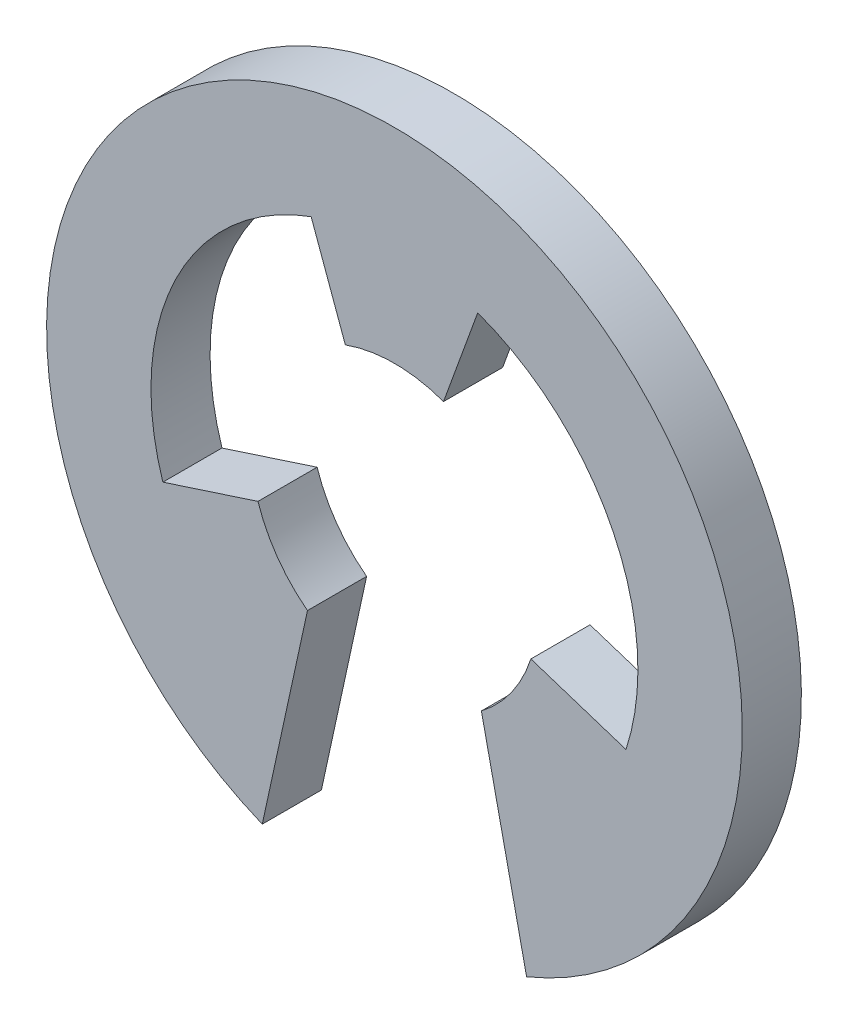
ISO-10303-21;
HEADER;
FILE_DESCRIPTION(('STEP AP214'),'2;1');
FILE_NAME('part.step','',(''),(''),'','','');
FILE_SCHEMA(('AUTOMOTIVE_DESIGN { 1 0 10303 214 1 1 1 1 }'));
ENDSEC;
DATA;
#1=APPLICATION_CONTEXT('core data for automotive mechanical design processes');
#2=APPLICATION_PROTOCOL_DEFINITION('international standard','automotive_design',2000,#1);
#3=PRODUCT_CONTEXT('',#1,'mechanical');
#4=PRODUCT('Part','Part','',(#3));
#5=PRODUCT_RELATED_PRODUCT_CATEGORY('part','',(#4));
#6=PRODUCT_DEFINITION_FORMATION('','',#4);
#7=PRODUCT_DEFINITION_CONTEXT('part definition',#1,'design');
#8=PRODUCT_DEFINITION('design','',#6,#7);
#9=PRODUCT_DEFINITION_SHAPE('','',#8);
#10=(LENGTH_UNIT() NAMED_UNIT(*) SI_UNIT(.MILLI.,.METRE.));
#11=(NAMED_UNIT(*) PLANE_ANGLE_UNIT() SI_UNIT($,.RADIAN.));
#12=(NAMED_UNIT(*) SI_UNIT($,.STERADIAN.) SOLID_ANGLE_UNIT());
#13=UNCERTAINTY_MEASURE_WITH_UNIT(LENGTH_MEASURE(1.E-05),#10,'distance_accuracy_value','');
#14=(GEOMETRIC_REPRESENTATION_CONTEXT(3) GLOBAL_UNCERTAINTY_ASSIGNED_CONTEXT((#13)) GLOBAL_UNIT_ASSIGNED_CONTEXT((#10,
#11,#12)) REPRESENTATION_CONTEXT('',''));
#15=CARTESIAN_POINT('',(0.,0.,0.));
#16=DIRECTION('',(0.,0.,1.));
#17=DIRECTION('',(1.,0.,0.));
#18=AXIS2_PLACEMENT_3D('',#15,#16,#17);
#19=CARTESIAN_POINT('',(0.,0.,0.68));
#20=DIRECTION('',(0.,0.,-1.));
#21=DIRECTION('',(-1.,0.,0.));
#22=AXIS2_PLACEMENT_3D('',#19,#20,#21);
#23=CYLINDRICAL_SURFACE('',#22,2.8);
#24=CARTESIAN_POINT('',(0.,0.,0.));
#25=DIRECTION('',(0.,0.,-1.));
#26=DIRECTION('',(1.,0.,0.));
#27=AXIS2_PLACEMENT_3D('',#24,#25,#26);
#28=CIRCLE('',#27,2.8);
#29=CARTESIAN_POINT('',(-2.66295824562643,-0.865247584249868,0.));
#30=VERTEX_POINT('',#29);
#31=CARTESIAN_POINT('',(-0.957656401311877,2.63113933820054,0.));
#32=VERTEX_POINT('',#31);
#33=EDGE_CURVE('E154',#30,#32,#28,.T.);
#34=ORIENTED_EDGE('',*,*,#33,.T.);
#35=DIRECTION('',(0.,0.,-1.));
#36=VECTOR('',#35,1.);
#37=CARTESIAN_POINT('',(-0.957656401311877,2.63113933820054,0.68));
#38=LINE('',#37,#36);
#39=CARTESIAN_POINT('',(-0.957656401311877,2.63113933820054,0.68));
#40=VERTEX_POINT('',#39);
#41=EDGE_CURVE('E11',#40,#32,#38,.T.);
#42=ORIENTED_EDGE('',*,*,#41,.F.);
#43=CARTESIAN_POINT('',(0.,0.,0.68));
#44=DIRECTION('',(0.,0.,-1.));
#45=DIRECTION('',(1.,0.,0.));
#46=AXIS2_PLACEMENT_3D('',#43,#44,#45);
#47=CIRCLE('',#46,2.8);
#48=CARTESIAN_POINT('',(-2.66295824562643,-0.865247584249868,0.68));
#49=VERTEX_POINT('',#48);
#50=EDGE_CURVE('E176',#49,#40,#47,.T.);
#51=ORIENTED_EDGE('',*,*,#50,.F.);
#52=DIRECTION('',(0.,0.,-1.));
#53=VECTOR('',#52,1.);
#54=CARTESIAN_POINT('',(-2.66295824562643,-0.865247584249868,0.68));
#55=LINE('',#54,#53);
#56=EDGE_CURVE('E150',#49,#30,#55,.T.);
#57=ORIENTED_EDGE('',*,*,#56,.T.);
#58=EDGE_LOOP('',(#34,#42,#51,#57));
#59=FACE_BOUND('',#58,.T.);
#60=ADVANCED_FACE('F34',(#59),#23,.F.);
#61=CARTESIAN_POINT('',(-0.564333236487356,1.55049282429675,0.68));
#62=DIRECTION('',(0.939692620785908,0.34202014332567,0.));
#63=DIRECTION('',(-0.34202014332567,0.939692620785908,0.));
#64=AXIS2_PLACEMENT_3D('',#61,#62,#63);
#65=PLANE('',#64);
#66=DIRECTION('',(0.34202014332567,-0.939692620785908,0.));
#67=VECTOR('',#66,1.);
#68=CARTESIAN_POINT('',(-0.564333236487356,1.55049282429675,0.));
#69=LINE('',#68,#67);
#70=CARTESIAN_POINT('',(-0.564333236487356,1.55049282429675,0.));
#71=VERTEX_POINT('',#70);
#72=EDGE_CURVE('E157',#32,#71,#69,.T.);
#73=ORIENTED_EDGE('',*,*,#72,.T.);
#74=DIRECTION('',(0.,0.,-1.));
#75=VECTOR('',#74,1.);
#76=CARTESIAN_POINT('',(-0.564333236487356,1.55049282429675,0.68));
#77=LINE('',#76,#75);
#78=CARTESIAN_POINT('',(-0.564333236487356,1.55049282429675,0.68));
#79=VERTEX_POINT('',#78);
#80=EDGE_CURVE('E42',#79,#71,#77,.T.);
#81=ORIENTED_EDGE('',*,*,#80,.F.);
#82=DIRECTION('',(0.34202014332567,-0.939692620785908,0.));
#83=VECTOR('',#82,1.);
#84=CARTESIAN_POINT('',(-0.564333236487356,1.55049282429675,0.68));
#85=LINE('',#84,#83);
#86=EDGE_CURVE('E105',#40,#79,#85,.T.);
#87=ORIENTED_EDGE('',*,*,#86,.F.);
#88=ORIENTED_EDGE('',*,*,#41,.T.);
#89=EDGE_LOOP('',(#73,#81,#87,#88));
#90=FACE_BOUND('',#89,.T.);
#91=ADVANCED_FACE('F254',(#90),#65,.F.);
#92=CARTESIAN_POINT('',(0.,0.,0.68));
#93=DIRECTION('',(0.,0.,-1.));
#94=DIRECTION('',(-1.,0.,0.));
#95=AXIS2_PLACEMENT_3D('',#92,#93,#94);
#96=CYLINDRICAL_SURFACE('',#95,1.65);
#97=CARTESIAN_POINT('',(0.,0.,0.));
#98=DIRECTION('',(0.,0.,-1.));
#99=DIRECTION('',(1.,0.,0.));
#100=AXIS2_PLACEMENT_3D('',#97,#98,#99);
#101=CIRCLE('',#100,1.65);
#102=CARTESIAN_POINT('',(0.564333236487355,1.55049282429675,0.));
#103=VERTEX_POINT('',#102);
#104=EDGE_CURVE('E159',#71,#103,#101,.T.);
#105=ORIENTED_EDGE('',*,*,#104,.T.);
#106=DIRECTION('',(0.,0.,-1.));
#107=VECTOR('',#106,1.);
#108=CARTESIAN_POINT('',(0.564333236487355,1.55049282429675,0.68));
#109=LINE('',#108,#107);
#110=CARTESIAN_POINT('',(0.564333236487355,1.55049282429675,0.68));
#111=VERTEX_POINT('',#110);
#112=EDGE_CURVE('E195',#111,#103,#109,.T.);
#113=ORIENTED_EDGE('',*,*,#112,.F.);
#114=CARTESIAN_POINT('',(0.,0.,0.68));
#115=DIRECTION('',(0.,0.,-1.));
#116=DIRECTION('',(1.,0.,0.));
#117=AXIS2_PLACEMENT_3D('',#114,#115,#116);
#118=CIRCLE('',#117,1.65);
#119=EDGE_CURVE('E203',#79,#111,#118,.T.);
#120=ORIENTED_EDGE('',*,*,#119,.F.);
#121=ORIENTED_EDGE('',*,*,#80,.T.);
#122=EDGE_LOOP('',(#105,#113,#120,#121));
#123=FACE_BOUND('',#122,.T.);
#124=ADVANCED_FACE('F201',(#123),#96,.F.);
#125=CARTESIAN_POINT('',(0.564333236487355,1.55049282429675,0.68));
#126=DIRECTION('',(-0.939692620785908,0.34202014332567,0.));
#127=DIRECTION('',(-0.34202014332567,-0.939692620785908,0.));
#128=AXIS2_PLACEMENT_3D('',#125,#126,#127);
#129=PLANE('',#128);
#130=DIRECTION('',(0.34202014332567,0.939692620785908,0.));
#131=VECTOR('',#130,1.);
#132=CARTESIAN_POINT('',(0.564333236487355,1.55049282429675,0.));
#133=LINE('',#132,#131);
#134=CARTESIAN_POINT('',(0.957656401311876,2.63113933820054,0.));
#135=VERTEX_POINT('',#134);
#136=EDGE_CURVE('E161',#103,#135,#133,.T.);
#137=ORIENTED_EDGE('',*,*,#136,.T.);
#138=DIRECTION('',(0.,0.,-1.));
#139=VECTOR('',#138,1.);
#140=CARTESIAN_POINT('',(0.957656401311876,2.63113933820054,0.68));
#141=LINE('',#140,#139);
#142=CARTESIAN_POINT('',(0.957656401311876,2.63113933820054,0.68));
#143=VERTEX_POINT('',#142);
#144=EDGE_CURVE('E192',#143,#135,#141,.T.);
#145=ORIENTED_EDGE('',*,*,#144,.F.);
#146=DIRECTION('',(0.34202014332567,0.939692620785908,0.));
#147=VECTOR('',#146,1.);
#148=CARTESIAN_POINT('',(0.564333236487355,1.55049282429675,0.68));
#149=LINE('',#148,#147);
#150=EDGE_CURVE('E221',#111,#143,#149,.T.);
#151=ORIENTED_EDGE('',*,*,#150,.F.);
#152=ORIENTED_EDGE('',*,*,#112,.T.);
#153=EDGE_LOOP('',(#137,#145,#151,#152));
#154=FACE_BOUND('',#153,.T.);
#155=ADVANCED_FACE('F212',(#154),#129,.F.);
#156=CARTESIAN_POINT('',(0.,0.,0.68));
#157=DIRECTION('',(0.,0.,-1.));
#158=DIRECTION('',(-1.,0.,0.));
#159=AXIS2_PLACEMENT_3D('',#156,#157,#158);
#160=CYLINDRICAL_SURFACE('',#159,2.8);
#161=CARTESIAN_POINT('',(0.,0.,0.));
#162=DIRECTION('',(0.,0.,-1.));
#163=DIRECTION('',(1.,0.,0.));
#164=AXIS2_PLACEMENT_3D('',#161,#162,#163);
#165=CIRCLE('',#164,2.8);
#166=CARTESIAN_POINT('',(2.66295824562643,-0.865247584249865,0.));
#167=VERTEX_POINT('',#166);
#168=EDGE_CURVE('E163',#135,#167,#165,.T.);
#169=ORIENTED_EDGE('',*,*,#168,.T.);
#170=DIRECTION('',(0.,0.,-1.));
#171=VECTOR('',#170,1.);
#172=CARTESIAN_POINT('',(2.66295824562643,-0.865247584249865,0.68));
#173=LINE('',#172,#171);
#174=CARTESIAN_POINT('',(2.66295824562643,-0.865247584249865,0.68));
#175=VERTEX_POINT('',#174);
#176=EDGE_CURVE('E189',#175,#167,#173,.T.);
#177=ORIENTED_EDGE('',*,*,#176,.F.);
#178=CARTESIAN_POINT('',(0.,0.,0.68));
#179=DIRECTION('',(0.,0.,-1.));
#180=DIRECTION('',(1.,0.,0.));
#181=AXIS2_PLACEMENT_3D('',#178,#179,#180);
#182=CIRCLE('',#181,2.8);
#183=EDGE_CURVE('E218',#143,#175,#182,.T.);
#184=ORIENTED_EDGE('',*,*,#183,.F.);
#185=ORIENTED_EDGE('',*,*,#144,.T.);
#186=EDGE_LOOP('',(#169,#177,#184,#185));
#187=FACE_BOUND('',#186,.T.);
#188=ADVANCED_FACE('F216',(#187),#160,.F.);
#189=CARTESIAN_POINT('',(1.569243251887,-0.50987804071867,0.68));
#190=DIRECTION('',(-0.309016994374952,-0.951056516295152,0.));
#191=DIRECTION('',(0.951056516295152,-0.309016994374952,0.));
#192=AXIS2_PLACEMENT_3D('',#189,#190,#191);
#193=PLANE('',#192);
#194=DIRECTION('',(-0.951056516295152,0.309016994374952,0.));
#195=VECTOR('',#194,1.);
#196=CARTESIAN_POINT('',(1.569243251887,-0.50987804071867,0.));
#197=LINE('',#196,#195);
#198=CARTESIAN_POINT('',(1.569243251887,-0.509878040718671,0.));
#199=VERTEX_POINT('',#198);
#200=EDGE_CURVE('E165',#167,#199,#197,.T.);
#201=ORIENTED_EDGE('',*,*,#200,.T.);
#202=DIRECTION('',(0.,0.,-1.));
#203=VECTOR('',#202,1.);
#204=CARTESIAN_POINT('',(1.569243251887,-0.509878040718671,0.68));
#205=LINE('',#204,#203);
#206=CARTESIAN_POINT('',(1.569243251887,-0.509878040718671,0.68));
#207=VERTEX_POINT('',#206);
#208=EDGE_CURVE('E186',#207,#199,#205,.T.);
#209=ORIENTED_EDGE('',*,*,#208,.F.);
#210=DIRECTION('',(-0.951056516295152,0.309016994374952,0.));
#211=VECTOR('',#210,1.);
#212=CARTESIAN_POINT('',(1.569243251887,-0.50987804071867,0.68));
#213=LINE('',#212,#211);
#214=EDGE_CURVE('E220',#175,#207,#213,.T.);
#215=ORIENTED_EDGE('',*,*,#214,.F.);
#216=ORIENTED_EDGE('',*,*,#176,.T.);
#217=EDGE_LOOP('',(#201,#209,#215,#216));
#218=FACE_BOUND('',#217,.T.);
#219=ADVANCED_FACE('F267',(#218),#193,.F.);
#220=CARTESIAN_POINT('',(0.,0.,0.68));
#221=DIRECTION('',(0.,0.,-1.));
#222=DIRECTION('',(-1.,0.,0.));
#223=AXIS2_PLACEMENT_3D('',#220,#221,#222);
#224=CYLINDRICAL_SURFACE('',#223,1.65);
#225=CARTESIAN_POINT('',(0.,0.,0.));
#226=DIRECTION('',(0.,0.,-1.));
#227=DIRECTION('',(1.,0.,0.));
#228=AXIS2_PLACEMENT_3D('',#225,#226,#227);
#229=CIRCLE('',#228,1.65);
#230=CARTESIAN_POINT('',(1.,-1.31244047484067,0.));
#231=VERTEX_POINT('',#230);
#232=EDGE_CURVE('E167',#199,#231,#229,.T.);
#233=ORIENTED_EDGE('',*,*,#232,.T.);
#234=DIRECTION('',(0.,0.,-1.));
#235=VECTOR('',#234,1.);
#236=CARTESIAN_POINT('',(1.,-1.31244047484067,0.68));
#237=LINE('',#236,#235);
#238=CARTESIAN_POINT('',(1.,-1.31244047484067,0.68));
#239=VERTEX_POINT('',#238);
#240=EDGE_CURVE('E183',#239,#231,#237,.T.);
#241=ORIENTED_EDGE('',*,*,#240,.F.);
#242=CARTESIAN_POINT('',(0.,0.,0.68));
#243=DIRECTION('',(0.,0.,-1.));
#244=DIRECTION('',(1.,0.,0.));
#245=AXIS2_PLACEMENT_3D('',#242,#243,#244);
#246=CIRCLE('',#245,1.65);
#247=EDGE_CURVE('E223',#207,#239,#246,.T.);
#248=ORIENTED_EDGE('',*,*,#247,.F.);
#249=ORIENTED_EDGE('',*,*,#208,.T.);
#250=EDGE_LOOP('',(#233,#241,#248,#249));
#251=FACE_BOUND('',#250,.T.);
#252=ADVANCED_FACE('F270',(#251),#224,.F.);
#253=CARTESIAN_POINT('',(1.,-1.31244047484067,0.68));
#254=DIRECTION('',(0.97710548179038,0.212755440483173,0.));
#255=DIRECTION('',(-0.212755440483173,0.97710548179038,0.));
#256=AXIS2_PLACEMENT_3D('',#253,#254,#255);
#257=PLANE('',#256);
#258=DIRECTION('',(0.212755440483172,-0.97710548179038,0.));
#259=VECTOR('',#258,1.);
#260=CARTESIAN_POINT('',(1.,-1.31244047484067,0.));
#261=LINE('',#260,#259);
#262=CARTESIAN_POINT('',(1.51986841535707,-3.7,0.));
#263=VERTEX_POINT('',#262);
#264=EDGE_CURVE('E169',#231,#263,#261,.T.);
#265=ORIENTED_EDGE('',*,*,#264,.T.);
#266=DIRECTION('',(0.,0.,-1.));
#267=VECTOR('',#266,1.);
#268=CARTESIAN_POINT('',(1.51986841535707,-3.7,0.68));
#269=LINE('',#268,#267);
#270=CARTESIAN_POINT('',(1.51986841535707,-3.7,0.68));
#271=VERTEX_POINT('',#270);
#272=EDGE_CURVE('E180',#271,#263,#269,.T.);
#273=ORIENTED_EDGE('',*,*,#272,.F.);
#274=DIRECTION('',(0.212755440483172,-0.97710548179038,0.));
#275=VECTOR('',#274,1.);
#276=CARTESIAN_POINT('',(1.,-1.31244047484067,0.68));
#277=LINE('',#276,#275);
#278=EDGE_CURVE('E229',#239,#271,#277,.T.);
#279=ORIENTED_EDGE('',*,*,#278,.F.);
#280=ORIENTED_EDGE('',*,*,#240,.T.);
#281=EDGE_LOOP('',(#265,#273,#279,#280));
#282=FACE_BOUND('',#281,.T.);
#283=ADVANCED_FACE('F235',(#282),#257,.F.);
#284=CARTESIAN_POINT('',(0.,0.,0.68));
#285=DIRECTION('',(0.,0.,-1.));
#286=DIRECTION('',(-1.,0.,0.));
#287=AXIS2_PLACEMENT_3D('',#284,#285,#286);
#288=CYLINDRICAL_SURFACE('',#287,4.);
#289=CARTESIAN_POINT('',(0.,0.,0.));
#290=DIRECTION('',(0.,0.,1.));
#291=DIRECTION('',(1.,0.,0.));
#292=AXIS2_PLACEMENT_3D('',#289,#290,#291);
#293=CIRCLE('',#292,4.);
#294=CARTESIAN_POINT('',(-1.51986841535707,-3.7,0.));
#295=VERTEX_POINT('',#294);
#296=EDGE_CURVE('E171',#263,#295,#293,.T.);
#297=ORIENTED_EDGE('',*,*,#296,.T.);
#298=DIRECTION('',(0.,0.,-1.));
#299=VECTOR('',#298,1.);
#300=CARTESIAN_POINT('',(-1.51986841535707,-3.7,0.68));
#301=LINE('',#300,#299);
#302=CARTESIAN_POINT('',(-1.51986841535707,-3.7,0.68));
#303=VERTEX_POINT('',#302);
#304=EDGE_CURVE('E145',#303,#295,#301,.T.);
#305=ORIENTED_EDGE('',*,*,#304,.F.);
#306=CARTESIAN_POINT('',(0.,0.,0.68));
#307=DIRECTION('',(0.,0.,1.));
#308=DIRECTION('',(1.,0.,0.));
#309=AXIS2_PLACEMENT_3D('',#306,#307,#308);
#310=CIRCLE('',#309,4.);
#311=EDGE_CURVE('E136',#271,#303,#310,.T.);
#312=ORIENTED_EDGE('',*,*,#311,.F.);
#313=ORIENTED_EDGE('',*,*,#272,.T.);
#314=EDGE_LOOP('',(#297,#305,#312,#313));
#315=FACE_BOUND('',#314,.T.);
#316=ADVANCED_FACE('F239',(#315),#288,.T.);
#317=CARTESIAN_POINT('',(-1.,-1.31244047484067,0.68));
#318=DIRECTION('',(-0.97710548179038,0.212755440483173,0.));
#319=DIRECTION('',(-0.212755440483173,-0.97710548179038,0.));
#320=AXIS2_PLACEMENT_3D('',#317,#318,#319);
#321=PLANE('',#320);
#322=DIRECTION('',(0.212755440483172,0.97710548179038,0.));
#323=VECTOR('',#322,1.);
#324=CARTESIAN_POINT('',(-1.,-1.31244047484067,0.));
#325=LINE('',#324,#323);
#326=CARTESIAN_POINT('',(-1.,-1.31244047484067,0.));
#327=VERTEX_POINT('',#326);
#328=EDGE_CURVE('E144',#295,#327,#325,.T.);
#329=ORIENTED_EDGE('',*,*,#328,.T.);
#330=DIRECTION('',(0.,0.,-1.));
#331=VECTOR('',#330,1.);
#332=CARTESIAN_POINT('',(-1.,-1.31244047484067,0.68));
#333=LINE('',#332,#331);
#334=CARTESIAN_POINT('',(-1.,-1.31244047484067,0.68));
#335=VERTEX_POINT('',#334);
#336=EDGE_CURVE('E141',#335,#327,#333,.T.);
#337=ORIENTED_EDGE('',*,*,#336,.F.);
#338=DIRECTION('',(0.212755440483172,0.97710548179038,0.));
#339=VECTOR('',#338,1.);
#340=CARTESIAN_POINT('',(-1.,-1.31244047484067,0.68));
#341=LINE('',#340,#339);
#342=EDGE_CURVE('E130',#303,#335,#341,.T.);
#343=ORIENTED_EDGE('',*,*,#342,.F.);
#344=ORIENTED_EDGE('',*,*,#304,.T.);
#345=EDGE_LOOP('',(#329,#337,#343,#344));
#346=FACE_BOUND('',#345,.T.);
#347=ADVANCED_FACE('F142',(#346),#321,.F.);
#348=CARTESIAN_POINT('',(0.,0.,0.68));
#349=DIRECTION('',(0.,0.,-1.));
#350=DIRECTION('',(-1.,0.,0.));
#351=AXIS2_PLACEMENT_3D('',#348,#349,#350);
#352=CYLINDRICAL_SURFACE('',#351,1.65);
#353=CARTESIAN_POINT('',(0.,0.,0.));
#354=DIRECTION('',(0.,0.,-1.));
#355=DIRECTION('',(1.,0.,0.));
#356=AXIS2_PLACEMENT_3D('',#353,#354,#355);
#357=CIRCLE('',#356,1.65);
#358=CARTESIAN_POINT('',(-1.569243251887,-0.509878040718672,0.));
#359=VERTEX_POINT('',#358);
#360=EDGE_CURVE('E91',#327,#359,#357,.T.);
#361=ORIENTED_EDGE('',*,*,#360,.T.);
#362=DIRECTION('',(0.,0.,-1.));
#363=VECTOR('',#362,1.);
#364=CARTESIAN_POINT('',(-1.569243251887,-0.509878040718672,0.68));
#365=LINE('',#364,#363);
#366=CARTESIAN_POINT('',(-1.569243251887,-0.509878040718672,0.68));
#367=VERTEX_POINT('',#366);
#368=EDGE_CURVE('E146',#367,#359,#365,.T.);
#369=ORIENTED_EDGE('',*,*,#368,.F.);
#370=CARTESIAN_POINT('',(0.,0.,0.68));
#371=DIRECTION('',(0.,0.,-1.));
#372=DIRECTION('',(1.,0.,0.));
#373=AXIS2_PLACEMENT_3D('',#370,#371,#372);
#374=CIRCLE('',#373,1.65);
#375=EDGE_CURVE('E134',#335,#367,#374,.T.);
#376=ORIENTED_EDGE('',*,*,#375,.F.);
#377=ORIENTED_EDGE('',*,*,#336,.T.);
#378=EDGE_LOOP('',(#361,#369,#376,#377));
#379=FACE_BOUND('',#378,.T.);
#380=ADVANCED_FACE('F148',(#379),#352,.F.);
#381=CARTESIAN_POINT('',(-1.569243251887,-0.509878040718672,0.68));
#382=DIRECTION('',(0.309016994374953,-0.951056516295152,0.));
#383=DIRECTION('',(0.951056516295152,0.309016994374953,0.));
#384=AXIS2_PLACEMENT_3D('',#381,#382,#383);
#385=PLANE('',#384);
#386=DIRECTION('',(-0.951056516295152,-0.309016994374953,0.));
#387=VECTOR('',#386,1.);
#388=CARTESIAN_POINT('',(-1.569243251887,-0.509878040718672,0.));
#389=LINE('',#388,#387);
#390=EDGE_CURVE('E97',#359,#30,#389,.T.);
#391=ORIENTED_EDGE('',*,*,#390,.T.);
#392=ORIENTED_EDGE('',*,*,#56,.F.);
#393=DIRECTION('',(-0.951056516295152,-0.309016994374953,0.));
#394=VECTOR('',#393,1.);
#395=CARTESIAN_POINT('',(-1.569243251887,-0.509878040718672,0.68));
#396=LINE('',#395,#394);
#397=EDGE_CURVE('E50',#367,#49,#396,.T.);
#398=ORIENTED_EDGE('',*,*,#397,.F.);
#399=ORIENTED_EDGE('',*,*,#368,.T.);
#400=EDGE_LOOP('',(#391,#392,#398,#399));
#401=FACE_BOUND('',#400,.T.);
#402=ADVANCED_FACE('F243',(#401),#385,.F.);
#403=CARTESIAN_POINT('',(0.,0.,0.68));
#404=DIRECTION('',(0.,0.,1.));
#405=DIRECTION('',(1.,0.,0.));
#406=AXIS2_PLACEMENT_3D('',#403,#404,#405);
#407=PLANE('',#406);
#408=ORIENTED_EDGE('',*,*,#50,.T.);
#409=ORIENTED_EDGE('',*,*,#86,.T.);
#410=ORIENTED_EDGE('',*,*,#119,.T.);
#411=ORIENTED_EDGE('',*,*,#150,.T.);
#412=ORIENTED_EDGE('',*,*,#183,.T.);
#413=ORIENTED_EDGE('',*,*,#214,.T.);
#414=ORIENTED_EDGE('',*,*,#247,.T.);
#415=ORIENTED_EDGE('',*,*,#278,.T.);
#416=ORIENTED_EDGE('',*,*,#311,.T.);
#417=ORIENTED_EDGE('',*,*,#342,.T.);
#418=ORIENTED_EDGE('',*,*,#375,.T.);
#419=ORIENTED_EDGE('',*,*,#397,.T.);
#420=EDGE_LOOP('',(#408,#409,#410,#411,#412,#413,#414,#415,#416,#417,#418,#419));
#421=FACE_BOUND('',#420,.T.);
#422=ADVANCED_FACE('F132',(#421),#407,.T.);
#423=CARTESIAN_POINT('',(0.,0.,0.));
#424=DIRECTION('',(0.,0.,1.));
#425=DIRECTION('',(1.,0.,0.));
#426=AXIS2_PLACEMENT_3D('',#423,#424,#425);
#427=PLANE('',#426);
#428=ORIENTED_EDGE('',*,*,#33,.F.);
#429=ORIENTED_EDGE('',*,*,#390,.F.);
#430=ORIENTED_EDGE('',*,*,#360,.F.);
#431=ORIENTED_EDGE('',*,*,#328,.F.);
#432=ORIENTED_EDGE('',*,*,#296,.F.);
#433=ORIENTED_EDGE('',*,*,#264,.F.);
#434=ORIENTED_EDGE('',*,*,#232,.F.);
#435=ORIENTED_EDGE('',*,*,#200,.F.);
#436=ORIENTED_EDGE('',*,*,#168,.F.);
#437=ORIENTED_EDGE('',*,*,#136,.F.);
#438=ORIENTED_EDGE('',*,*,#104,.F.);
#439=ORIENTED_EDGE('',*,*,#72,.F.);
#440=EDGE_LOOP('',(#428,#429,#430,#431,#432,#433,#434,#435,#436,#437,#438,#439));
#441=FACE_BOUND('',#440,.T.);
#442=ADVANCED_FACE('F207',(#441),#427,.F.);
#443=CLOSED_SHELL('',(#60,#91,#124,#155,#188,#219,#252,#283,#316,#347,#380,#402,#422,#442));
#444=MANIFOLD_SOLID_BREP('B2',#443);
#445=ADVANCED_BREP_SHAPE_REPRESENTATION('',(#18,#444),#14);
#446=SHAPE_DEFINITION_REPRESENTATION(#9,#445);
ENDSEC;
END-ISO-10303-21;
